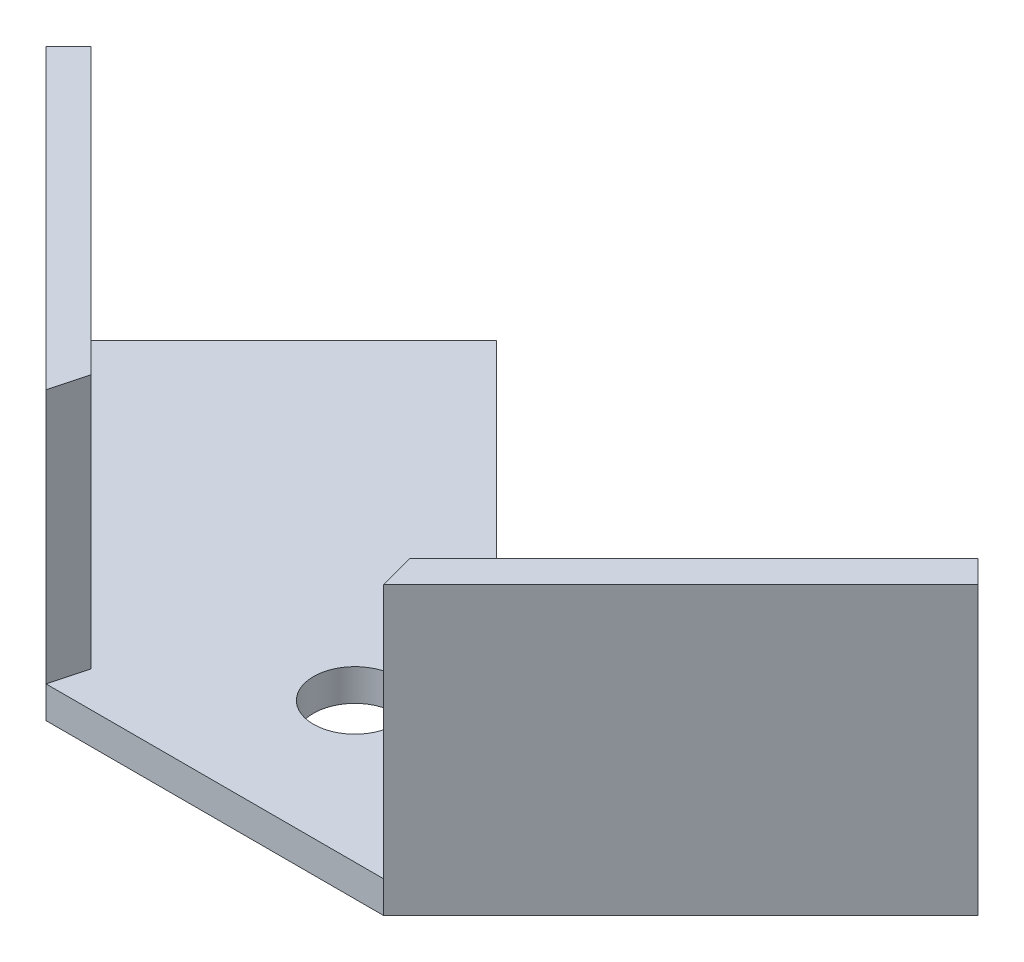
from build123d import *

# Parameters (mm, degrees)
SKETCH1_R           = 6.5
BOSS_EXTRUDE1_DEPTH = 5
BOSS_EXTRUDE2_DEPTH = 40


with BuildPart() as part:
    # Sketch1 → Boss-Extrude1 (new body)
    with BuildSketch(Plane(origin=(0, 0, 0), x_dir=(1, 0, 0), z_dir=(0, 1, 0))):
        Polygon((26.5, 0), (-26.5, 0), (-73.169047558, 46.669047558), (-37.813708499, 82.024386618), (0, 44.210678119), (37.813708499, 82.024386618), (73.169047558, 46.669047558), align=None)
        with Locations(Location((0, 22, 0), (0, 0, 270))):
            Circle(SKETCH1_R, mode=Mode.SUBTRACT)
    extrude(amount=BOSS_EXTRUDE1_DEPTH)

    # Sketch2 → Boss-Extrude2 (add)
    with BuildSketch(Plane(origin=(0, 5, 0), x_dir=(1, 0, 0), z_dir=(0, 1, 0))):
        Polygon((-73.169047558, 46.669047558), (-26.5, 0), (-25.005707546, 5.576775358), (-69.633513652, 50.204581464), align=None)
        Polygon((69.633513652, 50.204581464), (73.169047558, 46.669047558), (26.5, 0), (25.005707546, 5.576775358), align=None)
    extrude(amount=BOSS_EXTRUDE2_DEPTH)


solid = part.part
